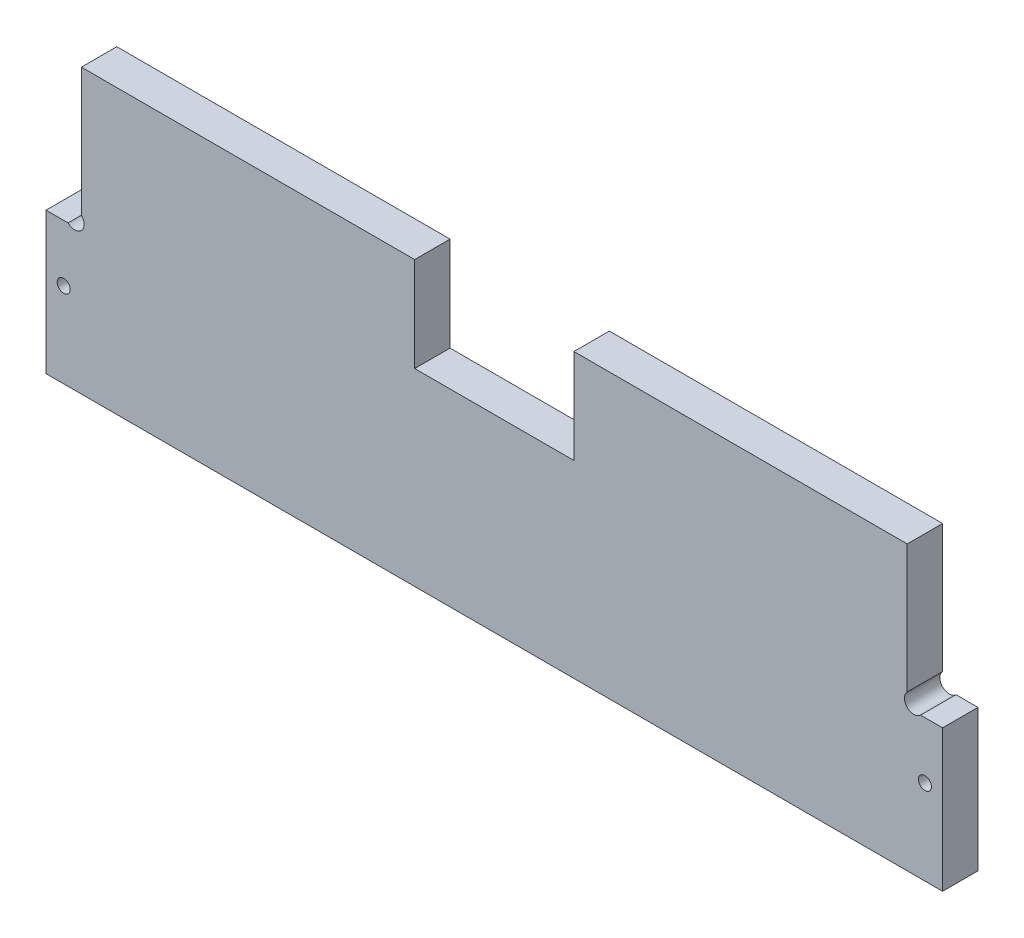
ISO-10303-21;
HEADER;
FILE_DESCRIPTION(('STEP AP214'),'2;1');
FILE_NAME('part.step','',(''),(''),'','','');
FILE_SCHEMA(('AUTOMOTIVE_DESIGN { 1 0 10303 214 1 1 1 1 }'));
ENDSEC;
DATA;
#1=APPLICATION_CONTEXT('core data for automotive mechanical design processes');
#2=APPLICATION_PROTOCOL_DEFINITION('international standard','automotive_design',2000,#1);
#3=PRODUCT_CONTEXT('',#1,'mechanical');
#4=PRODUCT('Part','Part','',(#3));
#5=PRODUCT_RELATED_PRODUCT_CATEGORY('part','',(#4));
#6=PRODUCT_DEFINITION_FORMATION('','',#4);
#7=PRODUCT_DEFINITION_CONTEXT('part definition',#1,'design');
#8=PRODUCT_DEFINITION('design','',#6,#7);
#9=PRODUCT_DEFINITION_SHAPE('','',#8);
#10=(LENGTH_UNIT() NAMED_UNIT(*) SI_UNIT(.MILLI.,.METRE.));
#11=(NAMED_UNIT(*) PLANE_ANGLE_UNIT() SI_UNIT($,.RADIAN.));
#12=(NAMED_UNIT(*) SI_UNIT($,.STERADIAN.) SOLID_ANGLE_UNIT());
#13=UNCERTAINTY_MEASURE_WITH_UNIT(LENGTH_MEASURE(1.E-05),#10,'distance_accuracy_value','');
#14=(GEOMETRIC_REPRESENTATION_CONTEXT(3) GLOBAL_UNCERTAINTY_ASSIGNED_CONTEXT((#13)) GLOBAL_UNIT_ASSIGNED_CONTEXT((#10,
#11,#12)) REPRESENTATION_CONTEXT('',''));
#15=CARTESIAN_POINT('',(0.,0.,0.));
#16=DIRECTION('',(0.,0.,1.));
#17=DIRECTION('',(1.,0.,0.));
#18=AXIS2_PLACEMENT_3D('',#15,#16,#17);
#19=CARTESIAN_POINT('',(-71.1313708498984,25.1313708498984,6.));
#20=DIRECTION('',(0.,0.,-1.));
#21=DIRECTION('',(-1.,0.,0.));
#22=AXIS2_PLACEMENT_3D('',#19,#20,#21);
#23=PLANE('',#22);
#24=DIRECTION('',(1.,0.,0.));
#25=VECTOR('',#24,1.);
#26=CARTESIAN_POINT('',(76.,0.,6.));
#27=LINE('',#26,#25);
#28=CARTESIAN_POINT('',(-76.,0.,6.));
#29=VERTEX_POINT('',#28);
#30=CARTESIAN_POINT('',(76.,0.,6.));
#31=VERTEX_POINT('',#30);
#32=EDGE_CURVE('E193',#29,#31,#27,.T.);
#33=ORIENTED_EDGE('',*,*,#32,.T.);
#34=DIRECTION('',(0.,1.,0.));
#35=VECTOR('',#34,1.);
#36=CARTESIAN_POINT('',(76.,24.,6.));
#37=LINE('',#36,#35);
#38=CARTESIAN_POINT('',(76.,24.,6.));
#39=VERTEX_POINT('',#38);
#40=EDGE_CURVE('E111',#31,#39,#37,.T.);
#41=ORIENTED_EDGE('',*,*,#40,.T.);
#42=DIRECTION('',(-1.,0.,0.));
#43=VECTOR('',#42,1.);
#44=CARTESIAN_POINT('',(72.2627416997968,24.,6.));
#45=LINE('',#44,#43);
#46=CARTESIAN_POINT('',(72.2627416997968,24.,6.));
#47=VERTEX_POINT('',#46);
#48=EDGE_CURVE('E226',#39,#47,#45,.T.);
#49=ORIENTED_EDGE('',*,*,#48,.T.);
#50=CARTESIAN_POINT('',(71.1313708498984,25.1313708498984,6.));
#51=DIRECTION('',(0.,0.,-1.));
#52=DIRECTION('',(1.,0.,0.));
#53=AXIS2_PLACEMENT_3D('',#50,#51,#52);
#54=CIRCLE('',#53,1.59999999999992);
#55=CARTESIAN_POINT('',(70.,26.2627416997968,6.));
#56=VERTEX_POINT('',#55);
#57=EDGE_CURVE('E245',#47,#56,#54,.T.);
#58=ORIENTED_EDGE('',*,*,#57,.T.);
#59=DIRECTION('',(0.,1.,0.));
#60=VECTOR('',#59,1.);
#61=CARTESIAN_POINT('',(70.,26.2627416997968,6.));
#62=LINE('',#61,#60);
#63=CARTESIAN_POINT('',(70.,48.,6.));
#64=VERTEX_POINT('',#63);
#65=EDGE_CURVE('E242',#56,#64,#62,.T.);
#66=ORIENTED_EDGE('',*,*,#65,.T.);
#67=DIRECTION('',(-1.,0.,0.));
#68=VECTOR('',#67,1.);
#69=CARTESIAN_POINT('',(13.5,48.,6.));
#70=LINE('',#69,#68);
#71=CARTESIAN_POINT('',(13.5,48.,6.));
#72=VERTEX_POINT('',#71);
#73=EDGE_CURVE('E244',#64,#72,#70,.T.);
#74=ORIENTED_EDGE('',*,*,#73,.T.);
#75=DIRECTION('',(0.,-1.,0.));
#76=VECTOR('',#75,1.);
#77=CARTESIAN_POINT('',(13.5,32.,6.));
#78=LINE('',#77,#76);
#79=CARTESIAN_POINT('',(13.5,32.,6.));
#80=VERTEX_POINT('',#79);
#81=EDGE_CURVE('E247',#72,#80,#78,.T.);
#82=ORIENTED_EDGE('',*,*,#81,.T.);
#83=DIRECTION('',(-1.,0.,0.));
#84=VECTOR('',#83,1.);
#85=CARTESIAN_POINT('',(-13.5,32.,6.));
#86=LINE('',#85,#84);
#87=CARTESIAN_POINT('',(-13.5,32.,6.));
#88=VERTEX_POINT('',#87);
#89=EDGE_CURVE('E253',#80,#88,#86,.T.);
#90=ORIENTED_EDGE('',*,*,#89,.T.);
#91=DIRECTION('',(0.,1.,0.));
#92=VECTOR('',#91,1.);
#93=CARTESIAN_POINT('',(-13.5,48.,6.));
#94=LINE('',#93,#92);
#95=CARTESIAN_POINT('',(-13.5,48.,6.));
#96=VERTEX_POINT('',#95);
#97=EDGE_CURVE('E255',#88,#96,#94,.T.);
#98=ORIENTED_EDGE('',*,*,#97,.T.);
#99=DIRECTION('',(-1.,0.,0.));
#100=VECTOR('',#99,1.);
#101=CARTESIAN_POINT('',(-70.,48.,6.));
#102=LINE('',#101,#100);
#103=CARTESIAN_POINT('',(-70.,48.,6.));
#104=VERTEX_POINT('',#103);
#105=EDGE_CURVE('E257',#96,#104,#102,.T.);
#106=ORIENTED_EDGE('',*,*,#105,.T.);
#107=DIRECTION('',(0.,-1.,0.));
#108=VECTOR('',#107,1.);
#109=CARTESIAN_POINT('',(-70.,26.2627416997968,6.));
#110=LINE('',#109,#108);
#111=CARTESIAN_POINT('',(-70.,26.2627416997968,6.));
#112=VERTEX_POINT('',#111);
#113=EDGE_CURVE('E148',#104,#112,#110,.T.);
#114=ORIENTED_EDGE('',*,*,#113,.T.);
#115=CARTESIAN_POINT('',(-71.1313708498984,25.1313708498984,6.));
#116=DIRECTION('',(0.,0.,-1.));
#117=DIRECTION('',(-1.,0.,0.));
#118=AXIS2_PLACEMENT_3D('',#115,#116,#117);
#119=CIRCLE('',#118,1.59999999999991);
#120=CARTESIAN_POINT('',(-72.2627416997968,24.,6.));
#121=VERTEX_POINT('',#120);
#122=EDGE_CURVE('E142',#112,#121,#119,.T.);
#123=ORIENTED_EDGE('',*,*,#122,.T.);
#124=DIRECTION('',(-1.,0.,0.));
#125=VECTOR('',#124,1.);
#126=CARTESIAN_POINT('',(-72.2627416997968,24.,6.));
#127=LINE('',#126,#125);
#128=CARTESIAN_POINT('',(-76.,24.,6.));
#129=VERTEX_POINT('',#128);
#130=EDGE_CURVE('E146',#121,#129,#127,.T.);
#131=ORIENTED_EDGE('',*,*,#130,.T.);
#132=DIRECTION('',(0.,-1.,0.));
#133=VECTOR('',#132,1.);
#134=CARTESIAN_POINT('',(-76.,24.,6.));
#135=LINE('',#134,#133);
#136=EDGE_CURVE('E50',#129,#29,#135,.T.);
#137=ORIENTED_EDGE('',*,*,#136,.T.);
#138=EDGE_LOOP('',(#33,#41,#49,#58,#66,#74,#82,#90,#98,#106,#114,#123,#131,#137));
#139=FACE_BOUND('',#138,.T.);
#140=CARTESIAN_POINT('',(73.,14.3920634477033,6.));
#141=DIRECTION('',(0.,0.,1.));
#142=DIRECTION('',(1.,0.,0.));
#143=AXIS2_PLACEMENT_3D('',#140,#141,#142);
#144=CIRCLE('',#143,1.10000000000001);
#145=CARTESIAN_POINT('',(74.1,14.3920634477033,6.));
#146=VERTEX_POINT('',#145);
#147=EDGE_CURVE('E170',#146,#146,#144,.T.);
#148=ORIENTED_EDGE('',*,*,#147,.F.);
#149=EDGE_LOOP('',(#148));
#150=FACE_BOUND('',#149,.T.);
#151=CARTESIAN_POINT('',(-73.,14.3920634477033,6.));
#152=DIRECTION('',(0.,0.,1.));
#153=DIRECTION('',(-1.,0.,0.));
#154=AXIS2_PLACEMENT_3D('',#151,#152,#153);
#155=CIRCLE('',#154,1.10000000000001);
#156=CARTESIAN_POINT('',(-74.1,14.3920634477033,6.));
#157=VERTEX_POINT('',#156);
#158=EDGE_CURVE('E298',#157,#157,#155,.T.);
#159=ORIENTED_EDGE('',*,*,#158,.F.);
#160=EDGE_LOOP('',(#159));
#161=FACE_BOUND('',#160,.T.);
#162=ADVANCED_FACE('F33',(#139,#150,#161),#23,.F.);
#163=CARTESIAN_POINT('',(-71.1313708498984,25.1313708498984,0.));
#164=DIRECTION('',(0.,0.,-1.));
#165=DIRECTION('',(-1.,0.,0.));
#166=AXIS2_PLACEMENT_3D('',#163,#164,#165);
#167=PLANE('',#166);
#168=CARTESIAN_POINT('',(73.,14.3920634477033,0.));
#169=DIRECTION('',(0.,0.,1.));
#170=DIRECTION('',(1.,0.,0.));
#171=AXIS2_PLACEMENT_3D('',#168,#169,#170);
#172=CIRCLE('',#171,1.10000000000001);
#173=CARTESIAN_POINT('',(74.1,14.3920634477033,0.));
#174=VERTEX_POINT('',#173);
#175=EDGE_CURVE('E303',#174,#174,#172,.T.);
#176=ORIENTED_EDGE('',*,*,#175,.T.);
#177=EDGE_LOOP('',(#176));
#178=FACE_BOUND('',#177,.T.);
#179=DIRECTION('',(1.,0.,0.));
#180=VECTOR('',#179,1.);
#181=CARTESIAN_POINT('',(76.,0.,0.));
#182=LINE('',#181,#180);
#183=CARTESIAN_POINT('',(-76.,0.,0.));
#184=VERTEX_POINT('',#183);
#185=CARTESIAN_POINT('',(76.,0.,0.));
#186=VERTEX_POINT('',#185);
#187=EDGE_CURVE('E166',#184,#186,#182,.T.);
#188=ORIENTED_EDGE('',*,*,#187,.F.);
#189=DIRECTION('',(0.,-1.,0.));
#190=VECTOR('',#189,1.);
#191=CARTESIAN_POINT('',(-76.,24.,0.));
#192=LINE('',#191,#190);
#193=CARTESIAN_POINT('',(-76.,24.,0.));
#194=VERTEX_POINT('',#193);
#195=EDGE_CURVE('E103',#194,#184,#192,.T.);
#196=ORIENTED_EDGE('',*,*,#195,.F.);
#197=DIRECTION('',(-1.,0.,0.));
#198=VECTOR('',#197,1.);
#199=CARTESIAN_POINT('',(-72.2627416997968,24.,0.));
#200=LINE('',#199,#198);
#201=CARTESIAN_POINT('',(-72.2627416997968,24.,0.));
#202=VERTEX_POINT('',#201);
#203=EDGE_CURVE('E97',#202,#194,#200,.T.);
#204=ORIENTED_EDGE('',*,*,#203,.F.);
#205=CARTESIAN_POINT('',(-71.1313708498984,25.1313708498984,0.));
#206=DIRECTION('',(0.,0.,-1.));
#207=DIRECTION('',(-1.,0.,0.));
#208=AXIS2_PLACEMENT_3D('',#205,#206,#207);
#209=CIRCLE('',#208,1.59999999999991);
#210=CARTESIAN_POINT('',(-70.,26.2627416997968,0.));
#211=VERTEX_POINT('',#210);
#212=EDGE_CURVE('E156',#211,#202,#209,.T.);
#213=ORIENTED_EDGE('',*,*,#212,.F.);
#214=DIRECTION('',(0.,-1.,0.));
#215=VECTOR('',#214,1.);
#216=CARTESIAN_POINT('',(-70.,26.2627416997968,0.));
#217=LINE('',#216,#215);
#218=CARTESIAN_POINT('',(-70.,48.,0.));
#219=VERTEX_POINT('',#218);
#220=EDGE_CURVE('E188',#219,#211,#217,.T.);
#221=ORIENTED_EDGE('',*,*,#220,.F.);
#222=DIRECTION('',(-1.,0.,0.));
#223=VECTOR('',#222,1.);
#224=CARTESIAN_POINT('',(-70.,48.,0.));
#225=LINE('',#224,#223);
#226=CARTESIAN_POINT('',(-13.5,48.,0.));
#227=VERTEX_POINT('',#226);
#228=EDGE_CURVE('E186',#227,#219,#225,.T.);
#229=ORIENTED_EDGE('',*,*,#228,.F.);
#230=DIRECTION('',(0.,1.,0.));
#231=VECTOR('',#230,1.);
#232=CARTESIAN_POINT('',(-13.5,48.,0.));
#233=LINE('',#232,#231);
#234=CARTESIAN_POINT('',(-13.5,32.,0.));
#235=VERTEX_POINT('',#234);
#236=EDGE_CURVE('E184',#235,#227,#233,.T.);
#237=ORIENTED_EDGE('',*,*,#236,.F.);
#238=DIRECTION('',(-1.,0.,0.));
#239=VECTOR('',#238,1.);
#240=CARTESIAN_POINT('',(-13.5,32.,0.));
#241=LINE('',#240,#239);
#242=CARTESIAN_POINT('',(13.5,32.,0.));
#243=VERTEX_POINT('',#242);
#244=EDGE_CURVE('E182',#243,#235,#241,.T.);
#245=ORIENTED_EDGE('',*,*,#244,.F.);
#246=DIRECTION('',(0.,-1.,0.));
#247=VECTOR('',#246,1.);
#248=CARTESIAN_POINT('',(13.5,32.,0.));
#249=LINE('',#248,#247);
#250=CARTESIAN_POINT('',(13.5,48.,0.));
#251=VERTEX_POINT('',#250);
#252=EDGE_CURVE('E180',#251,#243,#249,.T.);
#253=ORIENTED_EDGE('',*,*,#252,.F.);
#254=DIRECTION('',(-1.,0.,0.));
#255=VECTOR('',#254,1.);
#256=CARTESIAN_POINT('',(13.5,48.,0.));
#257=LINE('',#256,#255);
#258=CARTESIAN_POINT('',(70.,48.,0.));
#259=VERTEX_POINT('',#258);
#260=EDGE_CURVE('E178',#259,#251,#257,.T.);
#261=ORIENTED_EDGE('',*,*,#260,.F.);
#262=DIRECTION('',(0.,1.,0.));
#263=VECTOR('',#262,1.);
#264=CARTESIAN_POINT('',(70.,26.2627416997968,0.));
#265=LINE('',#264,#263);
#266=CARTESIAN_POINT('',(70.,26.2627416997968,0.));
#267=VERTEX_POINT('',#266);
#268=EDGE_CURVE('E176',#267,#259,#265,.T.);
#269=ORIENTED_EDGE('',*,*,#268,.F.);
#270=CARTESIAN_POINT('',(71.1313708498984,25.1313708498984,0.));
#271=DIRECTION('',(0.,0.,-1.));
#272=DIRECTION('',(1.,0.,0.));
#273=AXIS2_PLACEMENT_3D('',#270,#271,#272);
#274=CIRCLE('',#273,1.59999999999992);
#275=CARTESIAN_POINT('',(72.2627416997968,24.,0.));
#276=VERTEX_POINT('',#275);
#277=EDGE_CURVE('E174',#276,#267,#274,.T.);
#278=ORIENTED_EDGE('',*,*,#277,.F.);
#279=DIRECTION('',(-1.,0.,0.));
#280=VECTOR('',#279,1.);
#281=CARTESIAN_POINT('',(72.2627416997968,24.,0.));
#282=LINE('',#281,#280);
#283=CARTESIAN_POINT('',(76.,24.,0.));
#284=VERTEX_POINT('',#283);
#285=EDGE_CURVE('E172',#284,#276,#282,.T.);
#286=ORIENTED_EDGE('',*,*,#285,.F.);
#287=DIRECTION('',(0.,1.,0.));
#288=VECTOR('',#287,1.);
#289=CARTESIAN_POINT('',(76.,24.,0.));
#290=LINE('',#289,#288);
#291=EDGE_CURVE('E169',#186,#284,#290,.T.);
#292=ORIENTED_EDGE('',*,*,#291,.F.);
#293=EDGE_LOOP('',(#188,#196,#204,#213,#221,#229,#237,#245,#253,#261,#269,#278,#286,#292));
#294=FACE_BOUND('',#293,.T.);
#295=CARTESIAN_POINT('',(-73.,14.3920634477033,0.));
#296=DIRECTION('',(0.,0.,1.));
#297=DIRECTION('',(-1.,0.,0.));
#298=AXIS2_PLACEMENT_3D('',#295,#296,#297);
#299=CIRCLE('',#298,1.10000000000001);
#300=CARTESIAN_POINT('',(-74.1,14.3920634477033,0.));
#301=VERTEX_POINT('',#300);
#302=EDGE_CURVE('E301',#301,#301,#299,.T.);
#303=ORIENTED_EDGE('',*,*,#302,.T.);
#304=EDGE_LOOP('',(#303));
#305=FACE_BOUND('',#304,.T.);
#306=ADVANCED_FACE('F230',(#178,#294,#305),#167,.T.);
#307=CARTESIAN_POINT('',(76.,0.,6.));
#308=DIRECTION('',(0.,1.,0.));
#309=DIRECTION('',(0.,0.,1.));
#310=AXIS2_PLACEMENT_3D('',#307,#308,#309);
#311=PLANE('',#310);
#312=ORIENTED_EDGE('',*,*,#187,.T.);
#313=DIRECTION('',(0.,0.,-1.));
#314=VECTOR('',#313,1.);
#315=CARTESIAN_POINT('',(76.,0.,6.));
#316=LINE('',#315,#314);
#317=EDGE_CURVE('E11',#31,#186,#316,.T.);
#318=ORIENTED_EDGE('',*,*,#317,.F.);
#319=ORIENTED_EDGE('',*,*,#32,.F.);
#320=DIRECTION('',(0.,0.,-1.));
#321=VECTOR('',#320,1.);
#322=CARTESIAN_POINT('',(-76.,0.,6.));
#323=LINE('',#322,#321);
#324=EDGE_CURVE('E162',#29,#184,#323,.T.);
#325=ORIENTED_EDGE('',*,*,#324,.T.);
#326=EDGE_LOOP('',(#312,#318,#319,#325));
#327=FACE_BOUND('',#326,.T.);
#328=ADVANCED_FACE('F35',(#327),#311,.F.);
#329=CARTESIAN_POINT('',(76.,24.,6.));
#330=DIRECTION('',(-1.,0.,0.));
#331=DIRECTION('',(0.,0.,1.));
#332=AXIS2_PLACEMENT_3D('',#329,#330,#331);
#333=PLANE('',#332);
#334=ORIENTED_EDGE('',*,*,#291,.T.);
#335=DIRECTION('',(0.,0.,-1.));
#336=VECTOR('',#335,1.);
#337=CARTESIAN_POINT('',(76.,24.,6.));
#338=LINE('',#337,#336);
#339=EDGE_CURVE('E42',#39,#284,#338,.T.);
#340=ORIENTED_EDGE('',*,*,#339,.F.);
#341=ORIENTED_EDGE('',*,*,#40,.F.);
#342=ORIENTED_EDGE('',*,*,#317,.T.);
#343=EDGE_LOOP('',(#334,#340,#341,#342));
#344=FACE_BOUND('',#343,.T.);
#345=ADVANCED_FACE('F418',(#344),#333,.F.);
#346=CARTESIAN_POINT('',(72.2627416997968,24.,6.));
#347=DIRECTION('',(0.,-1.,0.));
#348=DIRECTION('',(1.,0.,0.));
#349=AXIS2_PLACEMENT_3D('',#346,#347,#348);
#350=PLANE('',#349);
#351=ORIENTED_EDGE('',*,*,#285,.T.);
#352=DIRECTION('',(0.,0.,-1.));
#353=VECTOR('',#352,1.);
#354=CARTESIAN_POINT('',(72.2627416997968,24.,6.));
#355=LINE('',#354,#353);
#356=EDGE_CURVE('E218',#47,#276,#355,.T.);
#357=ORIENTED_EDGE('',*,*,#356,.F.);
#358=ORIENTED_EDGE('',*,*,#48,.F.);
#359=ORIENTED_EDGE('',*,*,#339,.T.);
#360=EDGE_LOOP('',(#351,#357,#358,#359));
#361=FACE_BOUND('',#360,.T.);
#362=ADVANCED_FACE('F224',(#361),#350,.F.);
#363=CARTESIAN_POINT('',(71.1313708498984,25.1313708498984,6.));
#364=DIRECTION('',(0.,0.,-1.));
#365=DIRECTION('',(-1.,0.,0.));
#366=AXIS2_PLACEMENT_3D('',#363,#364,#365);
#367=CYLINDRICAL_SURFACE('',#366,1.59999999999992);
#368=ORIENTED_EDGE('',*,*,#277,.T.);
#369=DIRECTION('',(0.,0.,-1.));
#370=VECTOR('',#369,1.);
#371=CARTESIAN_POINT('',(70.,26.2627416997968,6.));
#372=LINE('',#371,#370);
#373=EDGE_CURVE('E215',#56,#267,#372,.T.);
#374=ORIENTED_EDGE('',*,*,#373,.F.);
#375=ORIENTED_EDGE('',*,*,#57,.F.);
#376=ORIENTED_EDGE('',*,*,#356,.T.);
#377=EDGE_LOOP('',(#368,#374,#375,#376));
#378=FACE_BOUND('',#377,.T.);
#379=ADVANCED_FACE('F236',(#378),#367,.F.);
#380=CARTESIAN_POINT('',(70.,26.2627416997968,6.));
#381=DIRECTION('',(-1.,0.,0.));
#382=DIRECTION('',(0.,-1.,0.));
#383=AXIS2_PLACEMENT_3D('',#380,#381,#382);
#384=PLANE('',#383);
#385=ORIENTED_EDGE('',*,*,#268,.T.);
#386=DIRECTION('',(0.,0.,-1.));
#387=VECTOR('',#386,1.);
#388=CARTESIAN_POINT('',(70.,48.,6.));
#389=LINE('',#388,#387);
#390=EDGE_CURVE('E212',#64,#259,#389,.T.);
#391=ORIENTED_EDGE('',*,*,#390,.F.);
#392=ORIENTED_EDGE('',*,*,#65,.F.);
#393=ORIENTED_EDGE('',*,*,#373,.T.);
#394=EDGE_LOOP('',(#385,#391,#392,#393));
#395=FACE_BOUND('',#394,.T.);
#396=ADVANCED_FACE('F240',(#395),#384,.F.);
#397=CARTESIAN_POINT('',(13.5,48.,6.));
#398=DIRECTION('',(0.,-1.,0.));
#399=DIRECTION('',(1.,0.,0.));
#400=AXIS2_PLACEMENT_3D('',#397,#398,#399);
#401=PLANE('',#400);
#402=ORIENTED_EDGE('',*,*,#260,.T.);
#403=DIRECTION('',(0.,0.,-1.));
#404=VECTOR('',#403,1.);
#405=CARTESIAN_POINT('',(13.5,48.,6.));
#406=LINE('',#405,#404);
#407=EDGE_CURVE('E209',#72,#251,#406,.T.);
#408=ORIENTED_EDGE('',*,*,#407,.F.);
#409=ORIENTED_EDGE('',*,*,#73,.F.);
#410=ORIENTED_EDGE('',*,*,#390,.T.);
#411=EDGE_LOOP('',(#402,#408,#409,#410));
#412=FACE_BOUND('',#411,.T.);
#413=ADVANCED_FACE('F383',(#412),#401,.F.);
#414=CARTESIAN_POINT('',(13.5,32.,6.));
#415=DIRECTION('',(1.,0.,0.));
#416=DIRECTION('',(0.,1.,0.));
#417=AXIS2_PLACEMENT_3D('',#414,#415,#416);
#418=PLANE('',#417);
#419=ORIENTED_EDGE('',*,*,#252,.T.);
#420=DIRECTION('',(0.,0.,-1.));
#421=VECTOR('',#420,1.);
#422=CARTESIAN_POINT('',(13.5,32.,6.));
#423=LINE('',#422,#421);
#424=EDGE_CURVE('E206',#80,#243,#423,.T.);
#425=ORIENTED_EDGE('',*,*,#424,.F.);
#426=ORIENTED_EDGE('',*,*,#81,.F.);
#427=ORIENTED_EDGE('',*,*,#407,.T.);
#428=EDGE_LOOP('',(#419,#425,#426,#427));
#429=FACE_BOUND('',#428,.T.);
#430=ADVANCED_FACE('F373',(#429),#418,.F.);
#431=CARTESIAN_POINT('',(-13.5,32.,6.));
#432=DIRECTION('',(0.,-1.,0.));
#433=DIRECTION('',(0.,0.,-1.));
#434=AXIS2_PLACEMENT_3D('',#431,#432,#433);
#435=PLANE('',#434);
#436=ORIENTED_EDGE('',*,*,#244,.T.);
#437=DIRECTION('',(0.,0.,-1.));
#438=VECTOR('',#437,1.);
#439=CARTESIAN_POINT('',(-13.5,32.,6.));
#440=LINE('',#439,#438);
#441=EDGE_CURVE('E203',#88,#235,#440,.T.);
#442=ORIENTED_EDGE('',*,*,#441,.F.);
#443=ORIENTED_EDGE('',*,*,#89,.F.);
#444=ORIENTED_EDGE('',*,*,#424,.T.);
#445=EDGE_LOOP('',(#436,#442,#443,#444));
#446=FACE_BOUND('',#445,.T.);
#447=ADVANCED_FACE('F363',(#446),#435,.F.);
#448=CARTESIAN_POINT('',(-13.5,48.,6.));
#449=DIRECTION('',(-1.,0.,0.));
#450=DIRECTION('',(0.,-1.,0.));
#451=AXIS2_PLACEMENT_3D('',#448,#449,#450);
#452=PLANE('',#451);
#453=ORIENTED_EDGE('',*,*,#236,.T.);
#454=DIRECTION('',(0.,0.,-1.));
#455=VECTOR('',#454,1.);
#456=CARTESIAN_POINT('',(-13.5,48.,6.));
#457=LINE('',#456,#455);
#458=EDGE_CURVE('E200',#96,#227,#457,.T.);
#459=ORIENTED_EDGE('',*,*,#458,.F.);
#460=ORIENTED_EDGE('',*,*,#97,.F.);
#461=ORIENTED_EDGE('',*,*,#441,.T.);
#462=EDGE_LOOP('',(#453,#459,#460,#461));
#463=FACE_BOUND('',#462,.T.);
#464=ADVANCED_FACE('F354',(#463),#452,.F.);
#465=CARTESIAN_POINT('',(-70.,48.,6.));
#466=DIRECTION('',(0.,-1.,0.));
#467=DIRECTION('',(0.,0.,-1.));
#468=AXIS2_PLACEMENT_3D('',#465,#466,#467);
#469=PLANE('',#468);
#470=ORIENTED_EDGE('',*,*,#228,.T.);
#471=DIRECTION('',(0.,0.,-1.));
#472=VECTOR('',#471,1.);
#473=CARTESIAN_POINT('',(-70.,48.,6.));
#474=LINE('',#473,#472);
#475=EDGE_CURVE('E197',#104,#219,#474,.T.);
#476=ORIENTED_EDGE('',*,*,#475,.F.);
#477=ORIENTED_EDGE('',*,*,#105,.F.);
#478=ORIENTED_EDGE('',*,*,#458,.T.);
#479=EDGE_LOOP('',(#470,#476,#477,#478));
#480=FACE_BOUND('',#479,.T.);
#481=ADVANCED_FACE('F263',(#480),#469,.F.);
#482=CARTESIAN_POINT('',(-70.,26.2627416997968,6.));
#483=DIRECTION('',(1.,0.,0.));
#484=DIRECTION('',(0.,0.,-1.));
#485=AXIS2_PLACEMENT_3D('',#482,#483,#484);
#486=PLANE('',#485);
#487=ORIENTED_EDGE('',*,*,#220,.T.);
#488=DIRECTION('',(0.,0.,-1.));
#489=VECTOR('',#488,1.);
#490=CARTESIAN_POINT('',(-70.,26.2627416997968,6.));
#491=LINE('',#490,#489);
#492=EDGE_CURVE('E157',#112,#211,#491,.T.);
#493=ORIENTED_EDGE('',*,*,#492,.F.);
#494=ORIENTED_EDGE('',*,*,#113,.F.);
#495=ORIENTED_EDGE('',*,*,#475,.T.);
#496=EDGE_LOOP('',(#487,#493,#494,#495));
#497=FACE_BOUND('',#496,.T.);
#498=ADVANCED_FACE('F267',(#497),#486,.F.);
#499=CARTESIAN_POINT('',(-71.1313708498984,25.1313708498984,6.));
#500=DIRECTION('',(0.,0.,-1.));
#501=DIRECTION('',(-1.,0.,0.));
#502=AXIS2_PLACEMENT_3D('',#499,#500,#501);
#503=CYLINDRICAL_SURFACE('',#502,1.59999999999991);
#504=ORIENTED_EDGE('',*,*,#212,.T.);
#505=DIRECTION('',(0.,0.,-1.));
#506=VECTOR('',#505,1.);
#507=CARTESIAN_POINT('',(-72.2627416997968,24.,6.));
#508=LINE('',#507,#506);
#509=EDGE_CURVE('E153',#121,#202,#508,.T.);
#510=ORIENTED_EDGE('',*,*,#509,.F.);
#511=ORIENTED_EDGE('',*,*,#122,.F.);
#512=ORIENTED_EDGE('',*,*,#492,.T.);
#513=EDGE_LOOP('',(#504,#510,#511,#512));
#514=FACE_BOUND('',#513,.T.);
#515=ADVANCED_FACE('F154',(#514),#503,.F.);
#516=CARTESIAN_POINT('',(-72.2627416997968,24.,6.));
#517=DIRECTION('',(0.,-1.,0.));
#518=DIRECTION('',(1.,0.,0.));
#519=AXIS2_PLACEMENT_3D('',#516,#517,#518);
#520=PLANE('',#519);
#521=ORIENTED_EDGE('',*,*,#203,.T.);
#522=DIRECTION('',(0.,0.,-1.));
#523=VECTOR('',#522,1.);
#524=CARTESIAN_POINT('',(-76.,24.,6.));
#525=LINE('',#524,#523);
#526=EDGE_CURVE('E158',#129,#194,#525,.T.);
#527=ORIENTED_EDGE('',*,*,#526,.F.);
#528=ORIENTED_EDGE('',*,*,#130,.F.);
#529=ORIENTED_EDGE('',*,*,#509,.T.);
#530=EDGE_LOOP('',(#521,#527,#528,#529));
#531=FACE_BOUND('',#530,.T.);
#532=ADVANCED_FACE('F160',(#531),#520,.F.);
#533=CARTESIAN_POINT('',(-76.,24.,6.));
#534=DIRECTION('',(1.,0.,0.));
#535=DIRECTION('',(0.,0.,-1.));
#536=AXIS2_PLACEMENT_3D('',#533,#534,#535);
#537=PLANE('',#536);
#538=ORIENTED_EDGE('',*,*,#195,.T.);
#539=ORIENTED_EDGE('',*,*,#324,.F.);
#540=ORIENTED_EDGE('',*,*,#136,.F.);
#541=ORIENTED_EDGE('',*,*,#526,.T.);
#542=EDGE_LOOP('',(#538,#539,#540,#541));
#543=FACE_BOUND('',#542,.T.);
#544=ADVANCED_FACE('F271',(#543),#537,.F.);
#545=CARTESIAN_POINT('',(73.,14.3920634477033,6.));
#546=DIRECTION('',(0.,0.,-1.));
#547=DIRECTION('',(-1.,0.,0.));
#548=AXIS2_PLACEMENT_3D('',#545,#546,#547);
#549=CYLINDRICAL_SURFACE('',#548,1.10000000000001);
#550=ORIENTED_EDGE('',*,*,#147,.T.);
#551=EDGE_LOOP('',(#550));
#552=FACE_BOUND('',#551,.T.);
#553=ORIENTED_EDGE('',*,*,#175,.F.);
#554=EDGE_LOOP('',(#553));
#555=FACE_BOUND('',#554,.T.);
#556=ADVANCED_FACE('F273',(#552,#555),#549,.F.);
#557=CARTESIAN_POINT('',(-73.,14.3920634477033,6.));
#558=DIRECTION('',(0.,0.,-1.));
#559=DIRECTION('',(-1.,0.,0.));
#560=AXIS2_PLACEMENT_3D('',#557,#558,#559);
#561=CYLINDRICAL_SURFACE('',#560,1.10000000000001);
#562=ORIENTED_EDGE('',*,*,#158,.T.);
#563=EDGE_LOOP('',(#562));
#564=FACE_BOUND('',#563,.T.);
#565=ORIENTED_EDGE('',*,*,#302,.F.);
#566=EDGE_LOOP('',(#565));
#567=FACE_BOUND('',#566,.T.);
#568=ADVANCED_FACE('F279',(#564,#567),#561,.F.);
#569=CLOSED_SHELL('',(#162,#306,#328,#345,#362,#379,#396,#413,#430,#447,#464,#481,#498,#515,
#532,#544,#556,#568));
#570=MANIFOLD_SOLID_BREP('B2',#569);
#571=ADVANCED_BREP_SHAPE_REPRESENTATION('',(#18,#570),#14);
#572=SHAPE_DEFINITION_REPRESENTATION(#9,#571);
ENDSEC;
END-ISO-10303-21;
